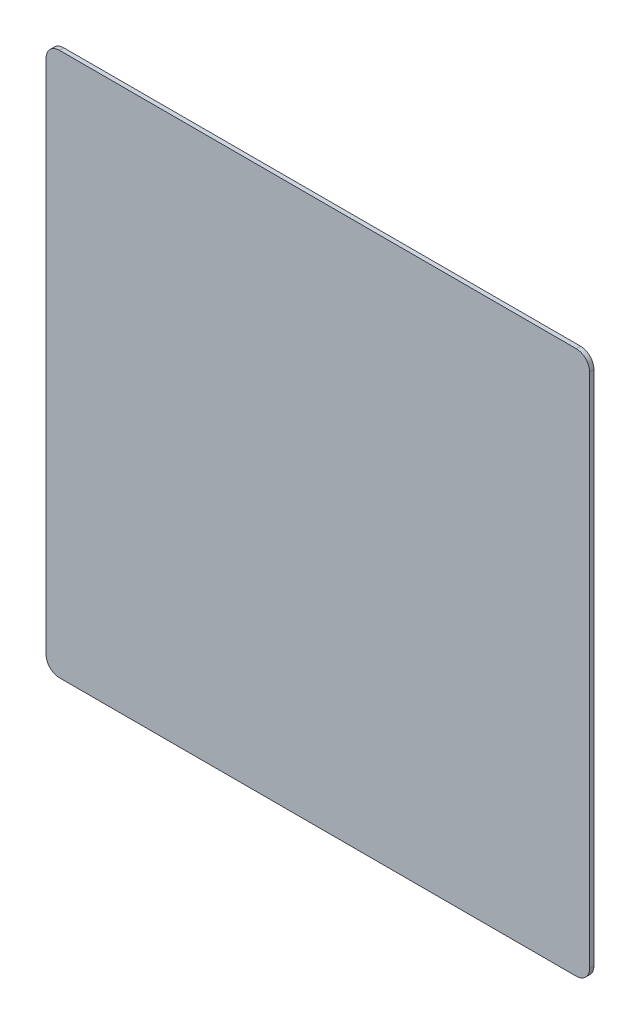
ISO-10303-21;
HEADER;
FILE_DESCRIPTION(('STEP AP214'),'2;1');
FILE_NAME('part.step','',(''),(''),'','','');
FILE_SCHEMA(('AUTOMOTIVE_DESIGN { 1 0 10303 214 1 1 1 1 }'));
ENDSEC;
DATA;
#1=APPLICATION_CONTEXT('core data for automotive mechanical design processes');
#2=APPLICATION_PROTOCOL_DEFINITION('international standard','automotive_design',2000,#1);
#3=PRODUCT_CONTEXT('',#1,'mechanical');
#4=PRODUCT('Part','Part','',(#3));
#5=PRODUCT_RELATED_PRODUCT_CATEGORY('part','',(#4));
#6=PRODUCT_DEFINITION_FORMATION('','',#4);
#7=PRODUCT_DEFINITION_CONTEXT('part definition',#1,'design');
#8=PRODUCT_DEFINITION('design','',#6,#7);
#9=PRODUCT_DEFINITION_SHAPE('','',#8);
#10=(LENGTH_UNIT() NAMED_UNIT(*) SI_UNIT(.MILLI.,.METRE.));
#11=(NAMED_UNIT(*) PLANE_ANGLE_UNIT() SI_UNIT($,.RADIAN.));
#12=(NAMED_UNIT(*) SI_UNIT($,.STERADIAN.) SOLID_ANGLE_UNIT());
#13=UNCERTAINTY_MEASURE_WITH_UNIT(LENGTH_MEASURE(1.E-05),#10,'distance_accuracy_value','');
#14=(GEOMETRIC_REPRESENTATION_CONTEXT(3) GLOBAL_UNCERTAINTY_ASSIGNED_CONTEXT((#13)) GLOBAL_UNIT_ASSIGNED_CONTEXT((#10,
#11,#12)) REPRESENTATION_CONTEXT('',''));
#15=CARTESIAN_POINT('',(0.,0.,0.));
#16=DIRECTION('',(0.,0.,1.));
#17=DIRECTION('',(1.,0.,0.));
#18=AXIS2_PLACEMENT_3D('',#15,#16,#17);
#19=CARTESIAN_POINT('',(29.9497474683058,29.4497474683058,0.5));
#20=DIRECTION('',(0.,0.,-1.));
#21=DIRECTION('',(-1.,0.,0.));
#22=AXIS2_PLACEMENT_3D('',#19,#20,#21);
#23=CYLINDRICAL_SURFACE('',#22,1.55);
#24=CARTESIAN_POINT('',(29.9497474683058,29.4497474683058,0.));
#25=DIRECTION('',(0.,0.,1.));
#26=DIRECTION('',(1.,0.,0.));
#27=AXIS2_PLACEMENT_3D('',#24,#25,#26);
#28=CIRCLE('',#27,1.55);
#29=CARTESIAN_POINT('',(31.4997474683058,29.4497474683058,0.));
#30=VERTEX_POINT('',#29);
#31=CARTESIAN_POINT('',(29.9497474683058,30.9997474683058,0.));
#32=VERTEX_POINT('',#31);
#33=EDGE_CURVE('E99',#30,#32,#28,.T.);
#34=ORIENTED_EDGE('',*,*,#33,.T.);
#35=DIRECTION('',(0.,0.,-1.));
#36=VECTOR('',#35,1.);
#37=CARTESIAN_POINT('',(29.9497474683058,30.9997474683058,0.5));
#38=LINE('',#37,#36);
#39=CARTESIAN_POINT('',(29.9497474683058,30.9997474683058,0.5));
#40=VERTEX_POINT('',#39);
#41=EDGE_CURVE('E11',#40,#32,#38,.T.);
#42=ORIENTED_EDGE('',*,*,#41,.F.);
#43=CARTESIAN_POINT('',(29.9497474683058,29.4497474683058,0.5));
#44=DIRECTION('',(0.,0.,1.));
#45=DIRECTION('',(1.,0.,0.));
#46=AXIS2_PLACEMENT_3D('',#43,#44,#45);
#47=CIRCLE('',#46,1.55);
#48=CARTESIAN_POINT('',(31.4997474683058,29.4497474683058,0.5));
#49=VERTEX_POINT('',#48);
#50=EDGE_CURVE('E126',#49,#40,#47,.T.);
#51=ORIENTED_EDGE('',*,*,#50,.F.);
#52=DIRECTION('',(0.,0.,-1.));
#53=VECTOR('',#52,1.);
#54=CARTESIAN_POINT('',(31.4997474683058,29.4497474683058,0.5));
#55=LINE('',#54,#53);
#56=EDGE_CURVE('E112',#49,#30,#55,.T.);
#57=ORIENTED_EDGE('',*,*,#56,.T.);
#58=EDGE_LOOP('',(#34,#42,#51,#57));
#59=FACE_BOUND('',#58,.T.);
#60=ADVANCED_FACE('F31',(#59),#23,.T.);
#61=CARTESIAN_POINT('',(29.9497474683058,30.9997474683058,0.5));
#62=DIRECTION('',(0.,-1.,0.));
#63=DIRECTION('',(0.,0.,-1.));
#64=AXIS2_PLACEMENT_3D('',#61,#62,#63);
#65=PLANE('',#64);
#66=DIRECTION('',(-1.,0.,0.));
#67=VECTOR('',#66,1.);
#68=CARTESIAN_POINT('',(29.9497474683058,30.9997474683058,0.));
#69=LINE('',#68,#67);
#70=CARTESIAN_POINT('',(-29.9497474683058,30.9997474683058,0.));
#71=VERTEX_POINT('',#70);
#72=EDGE_CURVE('E95',#32,#71,#69,.T.);
#73=ORIENTED_EDGE('',*,*,#72,.T.);
#74=DIRECTION('',(0.,0.,-1.));
#75=VECTOR('',#74,1.);
#76=CARTESIAN_POINT('',(-29.9497474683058,30.9997474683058,0.5));
#77=LINE('',#76,#75);
#78=CARTESIAN_POINT('',(-29.9497474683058,30.9997474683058,0.5));
#79=VERTEX_POINT('',#78);
#80=EDGE_CURVE('E38',#79,#71,#77,.T.);
#81=ORIENTED_EDGE('',*,*,#80,.F.);
#82=DIRECTION('',(-1.,0.,0.));
#83=VECTOR('',#82,1.);
#84=CARTESIAN_POINT('',(29.9497474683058,30.9997474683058,0.5));
#85=LINE('',#84,#83);
#86=EDGE_CURVE('E108',#40,#79,#85,.T.);
#87=ORIENTED_EDGE('',*,*,#86,.F.);
#88=ORIENTED_EDGE('',*,*,#41,.T.);
#89=EDGE_LOOP('',(#73,#81,#87,#88));
#90=FACE_BOUND('',#89,.T.);
#91=ADVANCED_FACE('F107',(#90),#65,.F.);
#92=CARTESIAN_POINT('',(-29.9497474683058,29.4497474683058,0.5));
#93=DIRECTION('',(0.,0.,-1.));
#94=DIRECTION('',(-1.,0.,0.));
#95=AXIS2_PLACEMENT_3D('',#92,#93,#94);
#96=CYLINDRICAL_SURFACE('',#95,1.55);
#97=CARTESIAN_POINT('',(-29.9497474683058,29.4497474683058,0.));
#98=DIRECTION('',(0.,0.,1.));
#99=DIRECTION('',(1.,0.,0.));
#100=AXIS2_PLACEMENT_3D('',#97,#98,#99);
#101=CIRCLE('',#100,1.55);
#102=CARTESIAN_POINT('',(-31.4997474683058,29.4497474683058,0.));
#103=VERTEX_POINT('',#102);
#104=EDGE_CURVE('E101',#71,#103,#101,.T.);
#105=ORIENTED_EDGE('',*,*,#104,.T.);
#106=DIRECTION('',(0.,0.,-1.));
#107=VECTOR('',#106,1.);
#108=CARTESIAN_POINT('',(-31.4997474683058,29.4497474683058,0.5));
#109=LINE('',#108,#107);
#110=CARTESIAN_POINT('',(-31.4997474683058,29.4497474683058,0.5));
#111=VERTEX_POINT('',#110);
#112=EDGE_CURVE('E152',#111,#103,#109,.T.);
#113=ORIENTED_EDGE('',*,*,#112,.F.);
#114=CARTESIAN_POINT('',(-29.9497474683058,29.4497474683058,0.5));
#115=DIRECTION('',(0.,0.,1.));
#116=DIRECTION('',(1.,0.,0.));
#117=AXIS2_PLACEMENT_3D('',#114,#115,#116);
#118=CIRCLE('',#117,1.55);
#119=EDGE_CURVE('E129',#79,#111,#118,.T.);
#120=ORIENTED_EDGE('',*,*,#119,.F.);
#121=ORIENTED_EDGE('',*,*,#80,.T.);
#122=EDGE_LOOP('',(#105,#113,#120,#121));
#123=FACE_BOUND('',#122,.T.);
#124=ADVANCED_FACE('F156',(#123),#96,.T.);
#125=CARTESIAN_POINT('',(-31.4997474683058,29.4497474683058,0.5));
#126=DIRECTION('',(1.,0.,0.));
#127=DIRECTION('',(0.,1.,0.));
#128=AXIS2_PLACEMENT_3D('',#125,#126,#127);
#129=PLANE('',#128);
#130=DIRECTION('',(0.,-1.,0.));
#131=VECTOR('',#130,1.);
#132=CARTESIAN_POINT('',(-31.4997474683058,29.4497474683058,0.));
#133=LINE('',#132,#131);
#134=CARTESIAN_POINT('',(-31.4997474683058,-30.4497474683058,0.));
#135=VERTEX_POINT('',#134);
#136=EDGE_CURVE('E116',#103,#135,#133,.T.);
#137=ORIENTED_EDGE('',*,*,#136,.T.);
#138=DIRECTION('',(0.,0.,-1.));
#139=VECTOR('',#138,1.);
#140=CARTESIAN_POINT('',(-31.4997474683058,-30.4497474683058,0.5));
#141=LINE('',#140,#139);
#142=CARTESIAN_POINT('',(-31.4997474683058,-30.4497474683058,0.5));
#143=VERTEX_POINT('',#142);
#144=EDGE_CURVE('E149',#143,#135,#141,.T.);
#145=ORIENTED_EDGE('',*,*,#144,.F.);
#146=DIRECTION('',(0.,-1.,0.));
#147=VECTOR('',#146,1.);
#148=CARTESIAN_POINT('',(-31.4997474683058,29.4497474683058,0.5));
#149=LINE('',#148,#147);
#150=EDGE_CURVE('E131',#111,#143,#149,.T.);
#151=ORIENTED_EDGE('',*,*,#150,.F.);
#152=ORIENTED_EDGE('',*,*,#112,.T.);
#153=EDGE_LOOP('',(#137,#145,#151,#152));
#154=FACE_BOUND('',#153,.T.);
#155=ADVANCED_FACE('F164',(#154),#129,.F.);
#156=CARTESIAN_POINT('',(-29.9497474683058,-30.4497474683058,0.5));
#157=DIRECTION('',(0.,0.,-1.));
#158=DIRECTION('',(-1.,0.,0.));
#159=AXIS2_PLACEMENT_3D('',#156,#157,#158);
#160=CYLINDRICAL_SURFACE('',#159,1.54999999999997);
#161=CARTESIAN_POINT('',(-29.9497474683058,-30.4497474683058,0.));
#162=DIRECTION('',(0.,0.,1.));
#163=DIRECTION('',(1.,0.,0.));
#164=AXIS2_PLACEMENT_3D('',#161,#162,#163);
#165=CIRCLE('',#164,1.54999999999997);
#166=CARTESIAN_POINT('',(-29.9497474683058,-31.9997474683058,0.));
#167=VERTEX_POINT('',#166);
#168=EDGE_CURVE('E118',#135,#167,#165,.T.);
#169=ORIENTED_EDGE('',*,*,#168,.T.);
#170=DIRECTION('',(0.,0.,-1.));
#171=VECTOR('',#170,1.);
#172=CARTESIAN_POINT('',(-29.9497474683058,-31.9997474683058,0.5));
#173=LINE('',#172,#171);
#174=CARTESIAN_POINT('',(-29.9497474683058,-31.9997474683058,0.5));
#175=VERTEX_POINT('',#174);
#176=EDGE_CURVE('E146',#175,#167,#173,.T.);
#177=ORIENTED_EDGE('',*,*,#176,.F.);
#178=CARTESIAN_POINT('',(-29.9497474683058,-30.4497474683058,0.5));
#179=DIRECTION('',(0.,0.,1.));
#180=DIRECTION('',(1.,0.,0.));
#181=AXIS2_PLACEMENT_3D('',#178,#179,#180);
#182=CIRCLE('',#181,1.54999999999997);
#183=EDGE_CURVE('E133',#143,#175,#182,.T.);
#184=ORIENTED_EDGE('',*,*,#183,.F.);
#185=ORIENTED_EDGE('',*,*,#144,.T.);
#186=EDGE_LOOP('',(#169,#177,#184,#185));
#187=FACE_BOUND('',#186,.T.);
#188=ADVANCED_FACE('F167',(#187),#160,.T.);
#189=CARTESIAN_POINT('',(-29.9497474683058,-31.9997474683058,0.5));
#190=DIRECTION('',(0.,1.,0.));
#191=DIRECTION('',(-1.,0.,0.));
#192=AXIS2_PLACEMENT_3D('',#189,#190,#191);
#193=PLANE('',#192);
#194=DIRECTION('',(1.,0.,0.));
#195=VECTOR('',#194,1.);
#196=CARTESIAN_POINT('',(-29.9497474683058,-31.9997474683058,0.));
#197=LINE('',#196,#195);
#198=CARTESIAN_POINT('',(29.9497474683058,-31.9997474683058,0.));
#199=VERTEX_POINT('',#198);
#200=EDGE_CURVE('E120',#167,#199,#197,.T.);
#201=ORIENTED_EDGE('',*,*,#200,.T.);
#202=DIRECTION('',(0.,0.,-1.));
#203=VECTOR('',#202,1.);
#204=CARTESIAN_POINT('',(29.9497474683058,-31.9997474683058,0.5));
#205=LINE('',#204,#203);
#206=CARTESIAN_POINT('',(29.9497474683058,-31.9997474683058,0.5));
#207=VERTEX_POINT('',#206);
#208=EDGE_CURVE('E143',#207,#199,#205,.T.);
#209=ORIENTED_EDGE('',*,*,#208,.F.);
#210=DIRECTION('',(1.,0.,0.));
#211=VECTOR('',#210,1.);
#212=CARTESIAN_POINT('',(-29.9497474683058,-31.9997474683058,0.5));
#213=LINE('',#212,#211);
#214=EDGE_CURVE('E135',#175,#207,#213,.T.);
#215=ORIENTED_EDGE('',*,*,#214,.F.);
#216=ORIENTED_EDGE('',*,*,#176,.T.);
#217=EDGE_LOOP('',(#201,#209,#215,#216));
#218=FACE_BOUND('',#217,.T.);
#219=ADVANCED_FACE('F172',(#218),#193,.F.);
#220=CARTESIAN_POINT('',(29.9497474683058,-30.4497474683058,0.5));
#221=DIRECTION('',(0.,0.,-1.));
#222=DIRECTION('',(-1.,0.,0.));
#223=AXIS2_PLACEMENT_3D('',#220,#221,#222);
#224=CYLINDRICAL_SURFACE('',#223,1.54999999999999);
#225=CARTESIAN_POINT('',(29.9497474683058,-30.4497474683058,0.));
#226=DIRECTION('',(0.,0.,1.));
#227=DIRECTION('',(1.,0.,0.));
#228=AXIS2_PLACEMENT_3D('',#225,#226,#227);
#229=CIRCLE('',#228,1.54999999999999);
#230=CARTESIAN_POINT('',(31.4997474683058,-30.4497474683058,0.));
#231=VERTEX_POINT('',#230);
#232=EDGE_CURVE('E122',#199,#231,#229,.T.);
#233=ORIENTED_EDGE('',*,*,#232,.T.);
#234=DIRECTION('',(0.,0.,-1.));
#235=VECTOR('',#234,1.);
#236=CARTESIAN_POINT('',(31.4997474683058,-30.4497474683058,0.5));
#237=LINE('',#236,#235);
#238=CARTESIAN_POINT('',(31.4997474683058,-30.4497474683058,0.5));
#239=VERTEX_POINT('',#238);
#240=EDGE_CURVE('E140',#239,#231,#237,.T.);
#241=ORIENTED_EDGE('',*,*,#240,.F.);
#242=CARTESIAN_POINT('',(29.9497474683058,-30.4497474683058,0.5));
#243=DIRECTION('',(0.,0.,1.));
#244=DIRECTION('',(1.,0.,0.));
#245=AXIS2_PLACEMENT_3D('',#242,#243,#244);
#246=CIRCLE('',#245,1.54999999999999);
#247=EDGE_CURVE('E50',#207,#239,#246,.T.);
#248=ORIENTED_EDGE('',*,*,#247,.F.);
#249=ORIENTED_EDGE('',*,*,#208,.T.);
#250=EDGE_LOOP('',(#233,#241,#248,#249));
#251=FACE_BOUND('',#250,.T.);
#252=ADVANCED_FACE('F175',(#251),#224,.T.);
#253=CARTESIAN_POINT('',(31.4997474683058,-30.4497474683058,0.5));
#254=DIRECTION('',(-1.,0.,0.));
#255=DIRECTION('',(0.,0.,1.));
#256=AXIS2_PLACEMENT_3D('',#253,#254,#255);
#257=PLANE('',#256);
#258=DIRECTION('',(0.,1.,0.));
#259=VECTOR('',#258,1.);
#260=CARTESIAN_POINT('',(31.4997474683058,-30.4497474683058,0.));
#261=LINE('',#260,#259);
#262=EDGE_CURVE('E124',#231,#30,#261,.T.);
#263=ORIENTED_EDGE('',*,*,#262,.T.);
#264=ORIENTED_EDGE('',*,*,#56,.F.);
#265=DIRECTION('',(0.,1.,0.));
#266=VECTOR('',#265,1.);
#267=CARTESIAN_POINT('',(31.4997474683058,-30.4497474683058,0.5));
#268=LINE('',#267,#266);
#269=EDGE_CURVE('E45',#239,#49,#268,.T.);
#270=ORIENTED_EDGE('',*,*,#269,.F.);
#271=ORIENTED_EDGE('',*,*,#240,.T.);
#272=EDGE_LOOP('',(#263,#264,#270,#271));
#273=FACE_BOUND('',#272,.T.);
#274=ADVANCED_FACE('F177',(#273),#257,.F.);
#275=CARTESIAN_POINT('',(29.9497474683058,29.4497474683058,0.5));
#276=DIRECTION('',(0.,0.,1.));
#277=DIRECTION('',(1.,0.,0.));
#278=AXIS2_PLACEMENT_3D('',#275,#276,#277);
#279=PLANE('',#278);
#280=ORIENTED_EDGE('',*,*,#50,.T.);
#281=ORIENTED_EDGE('',*,*,#86,.T.);
#282=ORIENTED_EDGE('',*,*,#119,.T.);
#283=ORIENTED_EDGE('',*,*,#150,.T.);
#284=ORIENTED_EDGE('',*,*,#183,.T.);
#285=ORIENTED_EDGE('',*,*,#214,.T.);
#286=ORIENTED_EDGE('',*,*,#247,.T.);
#287=ORIENTED_EDGE('',*,*,#269,.T.);
#288=EDGE_LOOP('',(#280,#281,#282,#283,#284,#285,#286,#287));
#289=FACE_BOUND('',#288,.T.);
#290=ADVANCED_FACE('F159',(#289),#279,.T.);
#291=CARTESIAN_POINT('',(29.9497474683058,29.4497474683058,0.));
#292=DIRECTION('',(0.,0.,1.));
#293=DIRECTION('',(1.,0.,0.));
#294=AXIS2_PLACEMENT_3D('',#291,#292,#293);
#295=PLANE('',#294);
#296=ORIENTED_EDGE('',*,*,#33,.F.);
#297=ORIENTED_EDGE('',*,*,#262,.F.);
#298=ORIENTED_EDGE('',*,*,#232,.F.);
#299=ORIENTED_EDGE('',*,*,#200,.F.);
#300=ORIENTED_EDGE('',*,*,#168,.F.);
#301=ORIENTED_EDGE('',*,*,#136,.F.);
#302=ORIENTED_EDGE('',*,*,#104,.F.);
#303=ORIENTED_EDGE('',*,*,#72,.F.);
#304=EDGE_LOOP('',(#296,#297,#298,#299,#300,#301,#302,#303));
#305=FACE_BOUND('',#304,.T.);
#306=ADVANCED_FACE('F96',(#305),#295,.F.);
#307=CLOSED_SHELL('',(#60,#91,#124,#155,#188,#219,#252,#274,#290,#306));
#308=MANIFOLD_SOLID_BREP('B2',#307);
#309=ADVANCED_BREP_SHAPE_REPRESENTATION('',(#18,#308),#14);
#310=SHAPE_DEFINITION_REPRESENTATION(#9,#309);
ENDSEC;
END-ISO-10303-21;
